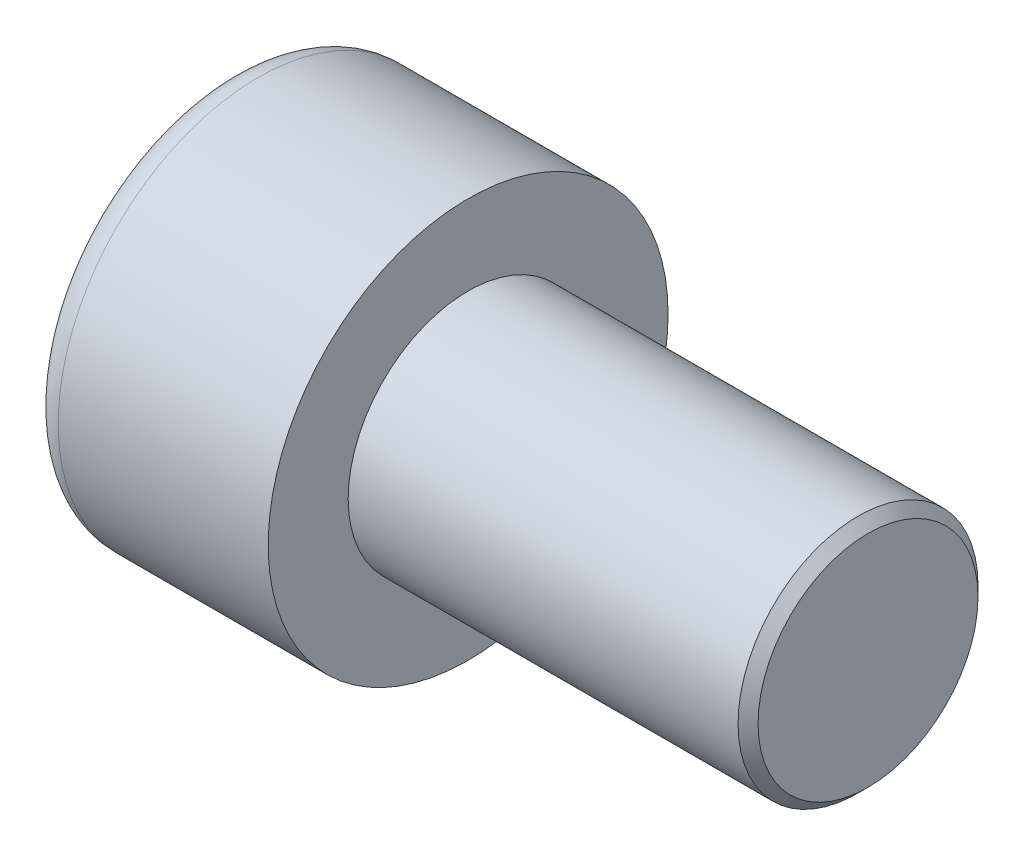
ISO-10303-21;
HEADER;
FILE_DESCRIPTION(('STEP AP214'),'2;1');
FILE_NAME('part.step','',(''),(''),'','','');
FILE_SCHEMA(('AUTOMOTIVE_DESIGN { 1 0 10303 214 1 1 1 1 }'));
ENDSEC;
DATA;
#1=APPLICATION_CONTEXT('core data for automotive mechanical design processes');
#2=APPLICATION_PROTOCOL_DEFINITION('international standard','automotive_design',2000,#1);
#3=PRODUCT_CONTEXT('',#1,'mechanical');
#4=PRODUCT('Part','Part','',(#3));
#5=PRODUCT_RELATED_PRODUCT_CATEGORY('part','',(#4));
#6=PRODUCT_DEFINITION_FORMATION('','',#4);
#7=PRODUCT_DEFINITION_CONTEXT('part definition',#1,'design');
#8=PRODUCT_DEFINITION('design','',#6,#7);
#9=PRODUCT_DEFINITION_SHAPE('','',#8);
#10=(LENGTH_UNIT() NAMED_UNIT(*) SI_UNIT(.MILLI.,.METRE.));
#11=(NAMED_UNIT(*) PLANE_ANGLE_UNIT() SI_UNIT($,.RADIAN.));
#12=(NAMED_UNIT(*) SI_UNIT($,.STERADIAN.) SOLID_ANGLE_UNIT());
#13=UNCERTAINTY_MEASURE_WITH_UNIT(LENGTH_MEASURE(1.E-05),#10,'distance_accuracy_value','');
#14=(GEOMETRIC_REPRESENTATION_CONTEXT(3) GLOBAL_UNCERTAINTY_ASSIGNED_CONTEXT((#13)) GLOBAL_UNIT_ASSIGNED_CONTEXT((#10,
#11,#12)) REPRESENTATION_CONTEXT('',''));
#15=CARTESIAN_POINT('',(0.,0.,0.));
#16=DIRECTION('',(0.,0.,1.));
#17=DIRECTION('',(1.,0.,0.));
#18=AXIS2_PLACEMENT_3D('',#15,#16,#17);
#19=CARTESIAN_POINT('',(3.,-5.,0.));
#20=DIRECTION('',(-1.,0.,0.));
#21=DIRECTION('',(0.,0.,1.));
#22=AXIS2_PLACEMENT_3D('',#19,#20,#21);
#23=PLANE('',#22);
#24=DIRECTION('',(0.,0.866025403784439,0.5));
#25=VECTOR('',#24,1.);
#26=CARTESIAN_POINT('',(3.,0.,-2.88675134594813));
#27=LINE('',#26,#25);
#28=CARTESIAN_POINT('',(3.,1.25,-2.1650635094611));
#29=VERTEX_POINT('',#28);
#30=CARTESIAN_POINT('',(3.,2.5,-1.44337567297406));
#31=VERTEX_POINT('',#30);
#32=EDGE_CURVE('E157',#29,#31,#27,.T.);
#33=ORIENTED_EDGE('',*,*,#32,.F.);
#34=CARTESIAN_POINT('',(3.,0.,0.));
#35=DIRECTION('',(1.,0.,0.));
#36=DIRECTION('',(0.,0.,-1.));
#37=AXIS2_PLACEMENT_3D('',#34,#35,#36);
#38=CIRCLE('',#37,2.5);
#39=CARTESIAN_POINT('',(3.,2.5,0.));
#40=VERTEX_POINT('',#39);
#41=EDGE_CURVE('E45',#29,#40,#38,.T.);
#42=ORIENTED_EDGE('',*,*,#41,.T.);
#43=DIRECTION('',(0.,0.,1.));
#44=VECTOR('',#43,1.);
#45=CARTESIAN_POINT('',(3.,2.5,-1.44337567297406));
#46=LINE('',#45,#44);
#47=EDGE_CURVE('E162',#31,#40,#46,.T.);
#48=ORIENTED_EDGE('',*,*,#47,.F.);
#49=EDGE_LOOP('',(#33,#42,#48));
#50=FACE_BOUND('',#49,.T.);
#51=ADVANCED_FACE('F30',(#50),#23,.T.);
#52=CARTESIAN_POINT('',(3.,2.5,1.44337567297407));
#53=VERTEX_POINT('',#52);
#54=EDGE_CURVE('E161',#40,#53,#46,.T.);
#55=ORIENTED_EDGE('',*,*,#54,.F.);
#56=CARTESIAN_POINT('',(3.,1.25,2.1650635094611));
#57=VERTEX_POINT('',#56);
#58=EDGE_CURVE('E213',#40,#57,#38,.T.);
#59=ORIENTED_EDGE('',*,*,#58,.T.);
#60=DIRECTION('',(0.,-0.866025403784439,0.5));
#61=VECTOR('',#60,1.);
#62=CARTESIAN_POINT('',(3.,2.5,1.44337567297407));
#63=LINE('',#62,#61);
#64=EDGE_CURVE('E166',#53,#57,#63,.T.);
#65=ORIENTED_EDGE('',*,*,#64,.F.);
#66=EDGE_LOOP('',(#55,#59,#65));
#67=FACE_BOUND('',#66,.T.);
#68=ADVANCED_FACE('F119',(#67),#23,.T.);
#69=CARTESIAN_POINT('',(3.,0.,2.88675134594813));
#70=VERTEX_POINT('',#69);
#71=EDGE_CURVE('E165',#57,#70,#63,.T.);
#72=ORIENTED_EDGE('',*,*,#71,.F.);
#73=CARTESIAN_POINT('',(3.,-1.25,2.1650635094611));
#74=VERTEX_POINT('',#73);
#75=EDGE_CURVE('E275',#57,#74,#38,.T.);
#76=ORIENTED_EDGE('',*,*,#75,.T.);
#77=DIRECTION('',(0.,-0.866025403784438,-0.5));
#78=VECTOR('',#77,1.);
#79=CARTESIAN_POINT('',(3.,0.,2.88675134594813));
#80=LINE('',#79,#78);
#81=EDGE_CURVE('E170',#70,#74,#80,.T.);
#82=ORIENTED_EDGE('',*,*,#81,.F.);
#83=EDGE_LOOP('',(#72,#76,#82));
#84=FACE_BOUND('',#83,.T.);
#85=ADVANCED_FACE('F125',(#84),#23,.T.);
#86=CARTESIAN_POINT('',(3.,-2.5,1.44337567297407));
#87=VERTEX_POINT('',#86);
#88=EDGE_CURVE('E169',#74,#87,#80,.T.);
#89=ORIENTED_EDGE('',*,*,#88,.F.);
#90=CARTESIAN_POINT('',(3.,-2.5,0.));
#91=VERTEX_POINT('',#90);
#92=EDGE_CURVE('E280',#74,#91,#38,.T.);
#93=ORIENTED_EDGE('',*,*,#92,.T.);
#94=DIRECTION('',(0.,0.,-1.));
#95=VECTOR('',#94,1.);
#96=CARTESIAN_POINT('',(3.,-2.5,1.44337567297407));
#97=LINE('',#96,#95);
#98=EDGE_CURVE('E174',#87,#91,#97,.T.);
#99=ORIENTED_EDGE('',*,*,#98,.F.);
#100=EDGE_LOOP('',(#89,#93,#99));
#101=FACE_BOUND('',#100,.T.);
#102=ADVANCED_FACE('F139',(#101),#23,.T.);
#103=CARTESIAN_POINT('',(3.,-2.5,-1.44337567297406));
#104=VERTEX_POINT('',#103);
#105=EDGE_CURVE('E173',#91,#104,#97,.T.);
#106=ORIENTED_EDGE('',*,*,#105,.F.);
#107=CARTESIAN_POINT('',(3.,-1.25,-2.1650635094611));
#108=VERTEX_POINT('',#107);
#109=EDGE_CURVE('E281',#91,#108,#38,.T.);
#110=ORIENTED_EDGE('',*,*,#109,.T.);
#111=DIRECTION('',(0.,0.866025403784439,-0.5));
#112=VECTOR('',#111,1.);
#113=CARTESIAN_POINT('',(3.,-2.5,-1.44337567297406));
#114=LINE('',#113,#112);
#115=EDGE_CURVE('E149',#104,#108,#114,.T.);
#116=ORIENTED_EDGE('',*,*,#115,.F.);
#117=EDGE_LOOP('',(#106,#110,#116));
#118=FACE_BOUND('',#117,.T.);
#119=ADVANCED_FACE('F130',(#118),#23,.T.);
#120=CARTESIAN_POINT('',(3.,0.,-2.88675134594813));
#121=VERTEX_POINT('',#120);
#122=EDGE_CURVE('E143',#108,#121,#114,.T.);
#123=ORIENTED_EDGE('',*,*,#122,.F.);
#124=EDGE_CURVE('E145',#108,#29,#38,.T.);
#125=ORIENTED_EDGE('',*,*,#124,.T.);
#126=EDGE_CURVE('E147',#121,#29,#27,.T.);
#127=ORIENTED_EDGE('',*,*,#126,.F.);
#128=EDGE_LOOP('',(#123,#125,#127));
#129=FACE_BOUND('',#128,.T.);
#130=ADVANCED_FACE('F121',(#129),#23,.T.);
#131=CARTESIAN_POINT('',(0.,0.,0.));
#132=DIRECTION('',(1.,0.,0.));
#133=DIRECTION('',(0.,0.,-1.));
#134=AXIS2_PLACEMENT_3D('',#131,#132,#133);
#135=PLANE('',#134);
#136=CARTESIAN_POINT('',(0.,0.,0.));
#137=DIRECTION('',(1.,0.,0.));
#138=DIRECTION('',(0.,0.,-1.));
#139=AXIS2_PLACEMENT_3D('',#136,#137,#138);
#140=CIRCLE('',#139,4.25);
#141=CARTESIAN_POINT('',(0.,0.,-4.25));
#142=VERTEX_POINT('',#141);
#143=EDGE_CURVE('E212',#142,#142,#140,.F.);
#144=ORIENTED_EDGE('',*,*,#143,.T.);
#145=EDGE_LOOP('',(#144));
#146=FACE_BOUND('',#145,.T.);
#147=DIRECTION('',(0.,0.866025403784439,-0.5));
#148=VECTOR('',#147,1.);
#149=CARTESIAN_POINT('',(0.,-2.5,-1.44337567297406));
#150=LINE('',#149,#148);
#151=CARTESIAN_POINT('',(0.,-2.5,-1.44337567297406));
#152=VERTEX_POINT('',#151);
#153=CARTESIAN_POINT('',(0.,0.,-2.88675134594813));
#154=VERTEX_POINT('',#153);
#155=EDGE_CURVE('E53',#152,#154,#150,.T.);
#156=ORIENTED_EDGE('',*,*,#155,.T.);
#157=DIRECTION('',(0.,0.866025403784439,0.5));
#158=VECTOR('',#157,1.);
#159=CARTESIAN_POINT('',(0.,0.,-2.88675134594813));
#160=LINE('',#159,#158);
#161=CARTESIAN_POINT('',(0.,2.5,-1.44337567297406));
#162=VERTEX_POINT('',#161);
#163=EDGE_CURVE('E178',#154,#162,#160,.T.);
#164=ORIENTED_EDGE('',*,*,#163,.T.);
#165=DIRECTION('',(0.,0.,1.));
#166=VECTOR('',#165,1.);
#167=CARTESIAN_POINT('',(0.,2.5,-1.44337567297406));
#168=LINE('',#167,#166);
#169=CARTESIAN_POINT('',(0.,2.5,1.44337567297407));
#170=VERTEX_POINT('',#169);
#171=EDGE_CURVE('E181',#162,#170,#168,.T.);
#172=ORIENTED_EDGE('',*,*,#171,.T.);
#173=DIRECTION('',(0.,-0.866025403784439,0.5));
#174=VECTOR('',#173,1.);
#175=CARTESIAN_POINT('',(0.,2.5,1.44337567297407));
#176=LINE('',#175,#174);
#177=CARTESIAN_POINT('',(0.,0.,2.88675134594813));
#178=VERTEX_POINT('',#177);
#179=EDGE_CURVE('E184',#170,#178,#176,.T.);
#180=ORIENTED_EDGE('',*,*,#179,.T.);
#181=DIRECTION('',(0.,-0.866025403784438,-0.5));
#182=VECTOR('',#181,1.);
#183=CARTESIAN_POINT('',(0.,0.,2.88675134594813));
#184=LINE('',#183,#182);
#185=CARTESIAN_POINT('',(0.,-2.5,1.44337567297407));
#186=VERTEX_POINT('',#185);
#187=EDGE_CURVE('E187',#178,#186,#184,.T.);
#188=ORIENTED_EDGE('',*,*,#187,.T.);
#189=DIRECTION('',(0.,0.,-1.));
#190=VECTOR('',#189,1.);
#191=CARTESIAN_POINT('',(0.,-2.5,1.44337567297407));
#192=LINE('',#191,#190);
#193=EDGE_CURVE('E150',#186,#152,#192,.T.);
#194=ORIENTED_EDGE('',*,*,#193,.T.);
#195=EDGE_LOOP('',(#156,#164,#172,#180,#188,#194));
#196=FACE_BOUND('',#195,.T.);
#197=ADVANCED_FACE('F129',(#146,#196),#135,.F.);
#198=CARTESIAN_POINT('',(6.,0.,0.));
#199=DIRECTION('',(1.,0.,0.));
#200=DIRECTION('',(0.,0.,-1.));
#201=AXIS2_PLACEMENT_3D('',#198,#199,#200);
#202=PLANE('',#201);
#203=CARTESIAN_POINT('',(6.,0.,0.));
#204=DIRECTION('',(1.,0.,0.));
#205=DIRECTION('',(0.,0.,-1.));
#206=AXIS2_PLACEMENT_3D('',#203,#204,#205);
#207=CIRCLE('',#206,5.);
#208=CARTESIAN_POINT('',(6.,0.,-5.));
#209=VERTEX_POINT('',#208);
#210=EDGE_CURVE('E206',#209,#209,#207,.T.);
#211=ORIENTED_EDGE('',*,*,#210,.T.);
#212=EDGE_LOOP('',(#211));
#213=FACE_BOUND('',#212,.T.);
#214=CARTESIAN_POINT('',(6.,0.,0.));
#215=DIRECTION('',(1.,0.,0.));
#216=DIRECTION('',(0.,0.,-1.));
#217=AXIS2_PLACEMENT_3D('',#214,#215,#216);
#218=CIRCLE('',#217,3.);
#219=CARTESIAN_POINT('',(6.,0.,-3.));
#220=VERTEX_POINT('',#219);
#221=EDGE_CURVE('E203',#220,#220,#218,.T.);
#222=ORIENTED_EDGE('',*,*,#221,.F.);
#223=EDGE_LOOP('',(#222));
#224=FACE_BOUND('',#223,.T.);
#225=ADVANCED_FACE('F136',(#213,#224),#202,.T.);
#226=CARTESIAN_POINT('',(6.,0.,0.));
#227=DIRECTION('',(-1.,0.,0.));
#228=DIRECTION('',(0.,0.,1.));
#229=AXIS2_PLACEMENT_3D('',#226,#227,#228);
#230=CYLINDRICAL_SURFACE('',#229,5.);
#231=CARTESIAN_POINT('',(0.75,0.,0.));
#232=DIRECTION('',(1.,0.,0.));
#233=DIRECTION('',(0.,0.,-1.));
#234=AXIS2_PLACEMENT_3D('',#231,#232,#233);
#235=CIRCLE('',#234,5.);
#236=CARTESIAN_POINT('',(0.75,0.,-5.));
#237=VERTEX_POINT('',#236);
#238=EDGE_CURVE('E209',#237,#237,#235,.T.);
#239=ORIENTED_EDGE('',*,*,#238,.T.);
#240=EDGE_LOOP('',(#239));
#241=FACE_BOUND('',#240,.T.);
#242=ORIENTED_EDGE('',*,*,#210,.F.);
#243=EDGE_LOOP('',(#242));
#244=FACE_BOUND('',#243,.T.);
#245=ADVANCED_FACE('F229',(#241,#244),#230,.T.);
#246=CARTESIAN_POINT('',(16.,0.,0.));
#247=DIRECTION('',(-1.,0.,0.));
#248=DIRECTION('',(0.,0.,1.));
#249=AXIS2_PLACEMENT_3D('',#246,#247,#248);
#250=CYLINDRICAL_SURFACE('',#249,3.);
#251=CARTESIAN_POINT('',(15.75,0.,0.));
#252=DIRECTION('',(1.,0.,0.));
#253=DIRECTION('',(0.,0.,-1.));
#254=AXIS2_PLACEMENT_3D('',#251,#252,#253);
#255=CIRCLE('',#254,3.);
#256=CARTESIAN_POINT('',(15.75,0.,-3.));
#257=VERTEX_POINT('',#256);
#258=EDGE_CURVE('E11',#257,#257,#255,.F.);
#259=ORIENTED_EDGE('',*,*,#258,.T.);
#260=EDGE_LOOP('',(#259));
#261=FACE_BOUND('',#260,.T.);
#262=ORIENTED_EDGE('',*,*,#221,.T.);
#263=EDGE_LOOP('',(#262));
#264=FACE_BOUND('',#263,.T.);
#265=ADVANCED_FACE('F226',(#261,#264),#250,.T.);
#266=CARTESIAN_POINT('',(16.,0.,0.));
#267=DIRECTION('',(1.,0.,0.));
#268=DIRECTION('',(0.,0.,-1.));
#269=AXIS2_PLACEMENT_3D('',#266,#267,#268);
#270=PLANE('',#269);
#271=CARTESIAN_POINT('',(16.,0.,0.));
#272=DIRECTION('',(1.,0.,0.));
#273=DIRECTION('',(0.,0.,-1.));
#274=AXIS2_PLACEMENT_3D('',#271,#272,#273);
#275=CIRCLE('',#274,2.75);
#276=CARTESIAN_POINT('',(16.,0.,-2.75));
#277=VERTEX_POINT('',#276);
#278=EDGE_CURVE('E38',#277,#277,#275,.T.);
#279=ORIENTED_EDGE('',*,*,#278,.T.);
#280=EDGE_LOOP('',(#279));
#281=FACE_BOUND('',#280,.T.);
#282=ADVANCED_FACE('F218',(#281),#270,.T.);
#283=CARTESIAN_POINT('',(3.,-2.5,-1.44337567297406));
#284=DIRECTION('',(0.,0.5,0.866025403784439));
#285=DIRECTION('',(0.,-0.866025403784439,0.5));
#286=AXIS2_PLACEMENT_3D('',#283,#284,#285);
#287=PLANE('',#286);
#288=ORIENTED_EDGE('',*,*,#155,.F.);
#289=DIRECTION('',(-1.,0.,0.));
#290=VECTOR('',#289,1.);
#291=CARTESIAN_POINT('',(3.,-2.5,-1.44337567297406));
#292=LINE('',#291,#290);
#293=EDGE_CURVE('E154',#104,#152,#292,.T.);
#294=ORIENTED_EDGE('',*,*,#293,.F.);
#295=ORIENTED_EDGE('',*,*,#115,.T.);
#296=ORIENTED_EDGE('',*,*,#122,.T.);
#297=DIRECTION('',(-1.,0.,0.));
#298=VECTOR('',#297,1.);
#299=CARTESIAN_POINT('',(3.,0.,-2.88675134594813));
#300=LINE('',#299,#298);
#301=EDGE_CURVE('E201',#121,#154,#300,.T.);
#302=ORIENTED_EDGE('',*,*,#301,.T.);
#303=EDGE_LOOP('',(#288,#294,#295,#296,#302));
#304=FACE_BOUND('',#303,.T.);
#305=ADVANCED_FACE('F153',(#304),#287,.T.);
#306=CARTESIAN_POINT('',(3.,0.,-2.88675134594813));
#307=DIRECTION('',(0.,-0.5,0.866025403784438));
#308=DIRECTION('',(0.,-0.866025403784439,-0.5));
#309=AXIS2_PLACEMENT_3D('',#306,#307,#308);
#310=PLANE('',#309);
#311=ORIENTED_EDGE('',*,*,#163,.F.);
#312=ORIENTED_EDGE('',*,*,#301,.F.);
#313=ORIENTED_EDGE('',*,*,#126,.T.);
#314=ORIENTED_EDGE('',*,*,#32,.T.);
#315=DIRECTION('',(-1.,0.,0.));
#316=VECTOR('',#315,1.);
#317=CARTESIAN_POINT('',(3.,2.5,-1.44337567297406));
#318=LINE('',#317,#316);
#319=EDGE_CURVE('E199',#31,#162,#318,.T.);
#320=ORIENTED_EDGE('',*,*,#319,.T.);
#321=EDGE_LOOP('',(#311,#312,#313,#314,#320));
#322=FACE_BOUND('',#321,.T.);
#323=ADVANCED_FACE('F246',(#322),#310,.T.);
#324=CARTESIAN_POINT('',(3.,2.5,-1.44337567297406));
#325=DIRECTION('',(0.,-1.,0.));
#326=DIRECTION('',(0.,0.,-1.));
#327=AXIS2_PLACEMENT_3D('',#324,#325,#326);
#328=PLANE('',#327);
#329=ORIENTED_EDGE('',*,*,#171,.F.);
#330=ORIENTED_EDGE('',*,*,#319,.F.);
#331=ORIENTED_EDGE('',*,*,#47,.T.);
#332=ORIENTED_EDGE('',*,*,#54,.T.);
#333=DIRECTION('',(-1.,0.,0.));
#334=VECTOR('',#333,1.);
#335=CARTESIAN_POINT('',(3.,2.5,1.44337567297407));
#336=LINE('',#335,#334);
#337=EDGE_CURVE('E197',#53,#170,#336,.T.);
#338=ORIENTED_EDGE('',*,*,#337,.T.);
#339=EDGE_LOOP('',(#329,#330,#331,#332,#338));
#340=FACE_BOUND('',#339,.T.);
#341=ADVANCED_FACE('F249',(#340),#328,.T.);
#342=CARTESIAN_POINT('',(3.,2.5,1.44337567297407));
#343=DIRECTION('',(0.,-0.5,-0.866025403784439));
#344=DIRECTION('',(0.,0.866025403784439,-0.5));
#345=AXIS2_PLACEMENT_3D('',#342,#343,#344);
#346=PLANE('',#345);
#347=ORIENTED_EDGE('',*,*,#179,.F.);
#348=ORIENTED_EDGE('',*,*,#337,.F.);
#349=ORIENTED_EDGE('',*,*,#64,.T.);
#350=ORIENTED_EDGE('',*,*,#71,.T.);
#351=DIRECTION('',(-1.,0.,0.));
#352=VECTOR('',#351,1.);
#353=CARTESIAN_POINT('',(3.,0.,2.88675134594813));
#354=LINE('',#353,#352);
#355=EDGE_CURVE('E195',#70,#178,#354,.T.);
#356=ORIENTED_EDGE('',*,*,#355,.T.);
#357=EDGE_LOOP('',(#347,#348,#349,#350,#356));
#358=FACE_BOUND('',#357,.T.);
#359=ADVANCED_FACE('F253',(#358),#346,.T.);
#360=CARTESIAN_POINT('',(3.,0.,2.88675134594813));
#361=DIRECTION('',(0.,0.5,-0.866025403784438));
#362=DIRECTION('',(0.,0.866025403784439,0.5));
#363=AXIS2_PLACEMENT_3D('',#360,#361,#362);
#364=PLANE('',#363);
#365=ORIENTED_EDGE('',*,*,#187,.F.);
#366=ORIENTED_EDGE('',*,*,#355,.F.);
#367=ORIENTED_EDGE('',*,*,#81,.T.);
#368=ORIENTED_EDGE('',*,*,#88,.T.);
#369=DIRECTION('',(-1.,0.,0.));
#370=VECTOR('',#369,1.);
#371=CARTESIAN_POINT('',(3.,-2.5,1.44337567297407));
#372=LINE('',#371,#370);
#373=EDGE_CURVE('E193',#87,#186,#372,.T.);
#374=ORIENTED_EDGE('',*,*,#373,.T.);
#375=EDGE_LOOP('',(#365,#366,#367,#368,#374));
#376=FACE_BOUND('',#375,.T.);
#377=ADVANCED_FACE('F114',(#376),#364,.T.);
#378=CARTESIAN_POINT('',(3.,-2.5,1.44337567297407));
#379=DIRECTION('',(0.,1.,0.));
#380=DIRECTION('',(0.,0.,1.));
#381=AXIS2_PLACEMENT_3D('',#378,#379,#380);
#382=PLANE('',#381);
#383=ORIENTED_EDGE('',*,*,#193,.F.);
#384=ORIENTED_EDGE('',*,*,#373,.F.);
#385=ORIENTED_EDGE('',*,*,#98,.T.);
#386=ORIENTED_EDGE('',*,*,#105,.T.);
#387=ORIENTED_EDGE('',*,*,#293,.T.);
#388=EDGE_LOOP('',(#383,#384,#385,#386,#387));
#389=FACE_BOUND('',#388,.T.);
#390=ADVANCED_FACE('F107',(#389),#382,.T.);
#391=CARTESIAN_POINT('',(3.,0.,0.));
#392=DIRECTION('',(-1.,0.,0.));
#393=DIRECTION('',(0.,0.,1.));
#394=AXIS2_PLACEMENT_3D('',#391,#392,#393);
#395=CONICAL_SURFACE('',#394,2.5,1.04719755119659);
#396=CARTESIAN_POINT('',(4.44337567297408,0.,0.));
#397=VERTEX_POINT('',#396);
#398=VERTEX_LOOP('',#397);
#399=FACE_BOUND('',#398,.T.);
#400=ORIENTED_EDGE('',*,*,#41,.F.);
#401=ORIENTED_EDGE('',*,*,#124,.F.);
#402=ORIENTED_EDGE('',*,*,#109,.F.);
#403=ORIENTED_EDGE('',*,*,#92,.F.);
#404=ORIENTED_EDGE('',*,*,#75,.F.);
#405=ORIENTED_EDGE('',*,*,#58,.F.);
#406=EDGE_LOOP('',(#400,#401,#402,#403,#404,#405));
#407=FACE_BOUND('',#406,.T.);
#408=ADVANCED_FACE('F104',(#399,#407),#395,.F.);
#409=CARTESIAN_POINT('',(0.75,0.,0.));
#410=DIRECTION('',(1.,0.,0.));
#411=DIRECTION('',(0.,0.,-1.));
#412=AXIS2_PLACEMENT_3D('',#409,#410,#411);
#413=TOROIDAL_SURFACE('',#412,4.25,0.75);
#414=ORIENTED_EDGE('',*,*,#143,.F.);
#415=EDGE_LOOP('',(#414));
#416=FACE_BOUND('',#415,.T.);
#417=ORIENTED_EDGE('',*,*,#238,.F.);
#418=EDGE_LOOP('',(#417));
#419=FACE_BOUND('',#418,.T.);
#420=ADVANCED_FACE('F106',(#416,#419),#413,.T.);
#421=CARTESIAN_POINT('',(16.,0.,0.));
#422=DIRECTION('',(-1.,0.,0.));
#423=DIRECTION('',(0.,0.,1.));
#424=AXIS2_PLACEMENT_3D('',#421,#422,#423);
#425=CONICAL_SURFACE('',#424,2.75,0.785398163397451);
#426=ORIENTED_EDGE('',*,*,#258,.F.);
#427=EDGE_LOOP('',(#426));
#428=FACE_BOUND('',#427,.T.);
#429=ORIENTED_EDGE('',*,*,#278,.F.);
#430=EDGE_LOOP('',(#429));
#431=FACE_BOUND('',#430,.T.);
#432=ADVANCED_FACE('F32',(#428,#431),#425,.T.);
#433=CLOSED_SHELL('',(#51,#68,#85,#102,#119,#130,#197,#225,#245,#265,#282,#305,#323,#341,#359,
#377,#390,#408,#420,#432));
#434=MANIFOLD_SOLID_BREP('B2',#433);
#435=ADVANCED_BREP_SHAPE_REPRESENTATION('',(#18,#434),#14);
#436=SHAPE_DEFINITION_REPRESENTATION(#9,#435);
ENDSEC;
END-ISO-10303-21;
